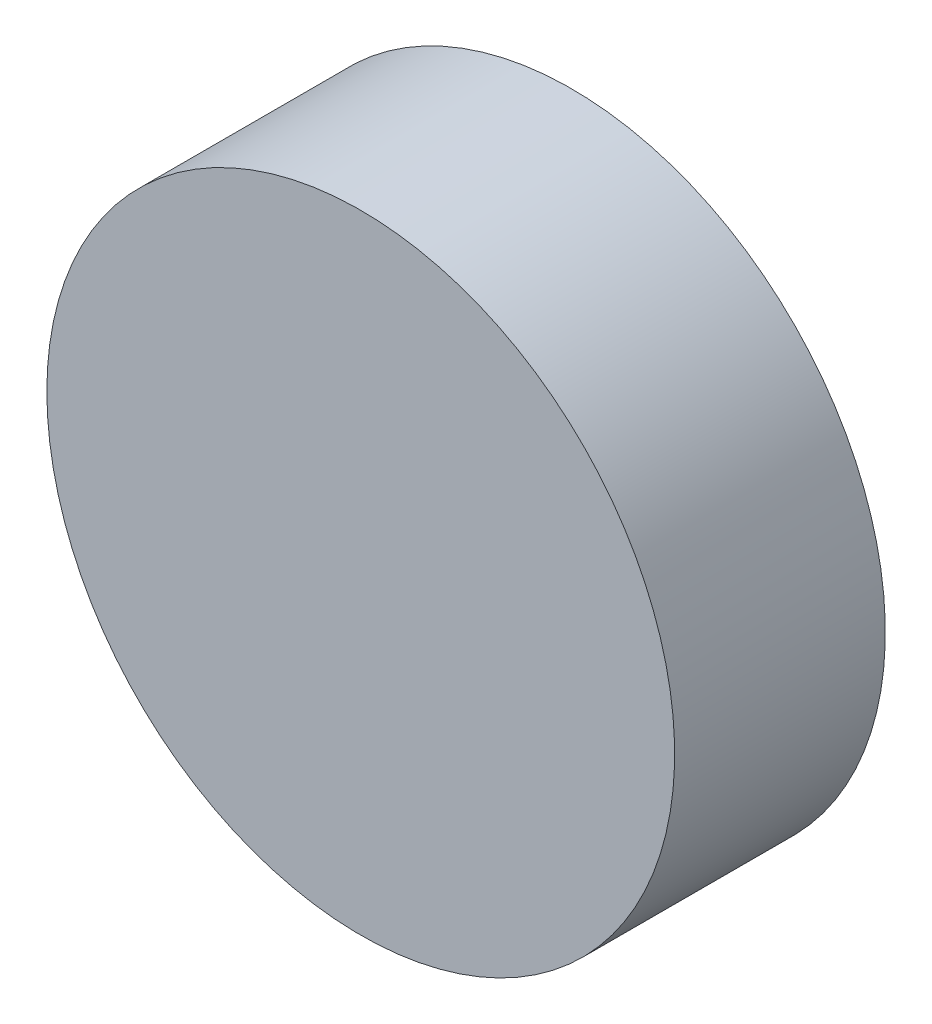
ISO-10303-21;
HEADER;
FILE_DESCRIPTION(('STEP AP214'),'2;1');
FILE_NAME('part.step','',(''),(''),'','','');
FILE_SCHEMA(('AUTOMOTIVE_DESIGN { 1 0 10303 214 1 1 1 1 }'));
ENDSEC;
DATA;
#1=APPLICATION_CONTEXT('core data for automotive mechanical design processes');
#2=APPLICATION_PROTOCOL_DEFINITION('international standard','automotive_design',2000,#1);
#3=PRODUCT_CONTEXT('',#1,'mechanical');
#4=PRODUCT('Part','Part','',(#3));
#5=PRODUCT_RELATED_PRODUCT_CATEGORY('part','',(#4));
#6=PRODUCT_DEFINITION_FORMATION('','',#4);
#7=PRODUCT_DEFINITION_CONTEXT('part definition',#1,'design');
#8=PRODUCT_DEFINITION('design','',#6,#7);
#9=PRODUCT_DEFINITION_SHAPE('','',#8);
#10=(LENGTH_UNIT() NAMED_UNIT(*) SI_UNIT(.MILLI.,.METRE.));
#11=(NAMED_UNIT(*) PLANE_ANGLE_UNIT() SI_UNIT($,.RADIAN.));
#12=(NAMED_UNIT(*) SI_UNIT($,.STERADIAN.) SOLID_ANGLE_UNIT());
#13=UNCERTAINTY_MEASURE_WITH_UNIT(LENGTH_MEASURE(1.E-05),#10,'distance_accuracy_value','');
#14=(GEOMETRIC_REPRESENTATION_CONTEXT(3) GLOBAL_UNCERTAINTY_ASSIGNED_CONTEXT((#13)) GLOBAL_UNIT_ASSIGNED_CONTEXT((#10,
#11,#12)) REPRESENTATION_CONTEXT('',''));
#15=CARTESIAN_POINT('',(0.,0.,0.));
#16=DIRECTION('',(0.,0.,1.));
#17=DIRECTION('',(1.,0.,0.));
#18=AXIS2_PLACEMENT_3D('',#15,#16,#17);
#19=CARTESIAN_POINT('',(0.,0.,19.177));
#20=DIRECTION('',(0.,0.,-1.));
#21=DIRECTION('',(-1.,0.,0.));
#22=AXIS2_PLACEMENT_3D('',#19,#20,#21);
#23=CYLINDRICAL_SURFACE('',#22,28.575);
#24=CARTESIAN_POINT('',(0.,0.,19.177));
#25=DIRECTION('',(0.,0.,1.));
#26=DIRECTION('',(1.,0.,0.));
#27=AXIS2_PLACEMENT_3D('',#24,#25,#26);
#28=CIRCLE('',#27,28.575);
#29=CARTESIAN_POINT('',(-28.575,0.,19.177));
#30=VERTEX_POINT('',#29);
#31=EDGE_CURVE('E10',#30,#30,#28,.T.);
#32=CARTESIAN_POINT('',(0.,0.,0.));
#33=DIRECTION('',(0.,0.,1.));
#34=DIRECTION('',(1.,0.,0.));
#35=AXIS2_PLACEMENT_3D('',#32,#33,#34);
#36=CIRCLE('',#35,28.575);
#37=CARTESIAN_POINT('',(-28.575,0.,0.));
#38=VERTEX_POINT('',#37);
#39=EDGE_CURVE('E37',#38,#38,#36,.T.);
#40=CARTESIAN_POINT('',(-28.575,0.,19.177));
#41=CARTESIAN_POINT('',(-28.575,0.,18.9772395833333));
#42=CARTESIAN_POINT('',(-28.575,0.,18.7774791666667));
#43=CARTESIAN_POINT('',(-28.575,0.,18.3779583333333));
#44=CARTESIAN_POINT('',(-28.575,0.,18.1781979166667));
#45=CARTESIAN_POINT('',(-28.575,0.,17.7786770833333));
#46=CARTESIAN_POINT('',(-28.575,0.,17.5789166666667));
#47=CARTESIAN_POINT('',(-28.575,0.,17.1793958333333));
#48=CARTESIAN_POINT('',(-28.575,0.,16.9796354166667));
#49=CARTESIAN_POINT('',(-28.575,0.,16.5801145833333));
#50=CARTESIAN_POINT('',(-28.575,0.,16.3803541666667));
#51=CARTESIAN_POINT('',(-28.575,0.,15.9808333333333));
#52=CARTESIAN_POINT('',(-28.575,0.,15.7810729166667));
#53=CARTESIAN_POINT('',(-28.575,0.,15.3815520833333));
#54=CARTESIAN_POINT('',(-28.575,0.,15.1817916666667));
#55=CARTESIAN_POINT('',(-28.575,0.,14.7822708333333));
#56=CARTESIAN_POINT('',(-28.575,0.,14.5825104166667));
#57=CARTESIAN_POINT('',(-28.575,0.,14.1829895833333));
#58=CARTESIAN_POINT('',(-28.575,0.,13.9832291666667));
#59=CARTESIAN_POINT('',(-28.575,0.,13.5837083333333));
#60=CARTESIAN_POINT('',(-28.575,0.,13.3839479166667));
#61=CARTESIAN_POINT('',(-28.575,0.,12.9844270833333));
#62=CARTESIAN_POINT('',(-28.575,0.,12.7846666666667));
#63=CARTESIAN_POINT('',(-28.575,0.,12.3851458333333));
#64=CARTESIAN_POINT('',(-28.575,0.,12.1853854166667));
#65=CARTESIAN_POINT('',(-28.575,0.,11.7858645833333));
#66=CARTESIAN_POINT('',(-28.575,0.,11.5861041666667));
#67=CARTESIAN_POINT('',(-28.575,0.,11.1865833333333));
#68=CARTESIAN_POINT('',(-28.575,0.,10.9868229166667));
#69=CARTESIAN_POINT('',(-28.575,0.,10.5873020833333));
#70=CARTESIAN_POINT('',(-28.575,0.,10.3875416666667));
#71=CARTESIAN_POINT('',(-28.575,0.,9.98802083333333));
#72=CARTESIAN_POINT('',(-28.575,0.,9.78826041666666));
#73=CARTESIAN_POINT('',(-28.575,0.,9.38873958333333));
#74=CARTESIAN_POINT('',(-28.575,0.,9.18897916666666));
#75=CARTESIAN_POINT('',(-28.575,0.,8.78945833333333));
#76=CARTESIAN_POINT('',(-28.575,0.,8.58969791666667));
#77=CARTESIAN_POINT('',(-28.575,0.,8.19017708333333));
#78=CARTESIAN_POINT('',(-28.575,0.,7.99041666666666));
#79=CARTESIAN_POINT('',(-28.575,0.,7.59089583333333));
#80=CARTESIAN_POINT('',(-28.575,0.,7.39113541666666));
#81=CARTESIAN_POINT('',(-28.575,0.,6.99161458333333));
#82=CARTESIAN_POINT('',(-28.575,0.,6.79185416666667));
#83=CARTESIAN_POINT('',(-28.575,0.,6.39233333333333));
#84=CARTESIAN_POINT('',(-28.575,0.,6.19257291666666));
#85=CARTESIAN_POINT('',(-28.575,0.,5.79305208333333));
#86=CARTESIAN_POINT('',(-28.575,0.,5.59329166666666));
#87=CARTESIAN_POINT('',(-28.575,0.,5.19377083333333));
#88=CARTESIAN_POINT('',(-28.575,0.,4.99401041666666));
#89=CARTESIAN_POINT('',(-28.575,0.,4.59448958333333));
#90=CARTESIAN_POINT('',(-28.575,0.,4.39472916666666));
#91=CARTESIAN_POINT('',(-28.575,0.,3.99520833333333));
#92=CARTESIAN_POINT('',(-28.575,0.,3.79544791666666));
#93=CARTESIAN_POINT('',(-28.575,0.,3.39592708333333));
#94=CARTESIAN_POINT('',(-28.575,0.,3.19616666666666));
#95=CARTESIAN_POINT('',(-28.575,0.,2.79664583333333));
#96=CARTESIAN_POINT('',(-28.575,0.,2.59688541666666));
#97=CARTESIAN_POINT('',(-28.575,0.,2.19736458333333));
#98=CARTESIAN_POINT('',(-28.575,0.,1.99760416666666));
#99=CARTESIAN_POINT('',(-28.575,0.,1.59808333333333));
#100=CARTESIAN_POINT('',(-28.575,0.,1.39832291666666));
#101=CARTESIAN_POINT('',(-28.575,0.,0.99880208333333));
#102=CARTESIAN_POINT('',(-28.575,0.,0.799041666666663));
#103=CARTESIAN_POINT('',(-28.575,0.,0.39952083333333));
#104=CARTESIAN_POINT('',(-28.575,0.,0.199760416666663));
#105=CARTESIAN_POINT('',(-28.575,0.,0.));
#106=B_SPLINE_CURVE_WITH_KNOTS('',3,(#40,#41,#42,#43,#44,#45,#46,#47,#48,#49,#50,#51,#52,#53,
#54,#55,#56,#57,#58,#59,#60,#61,#62,#63,#64,#65,#66,#67,#68,#69,#70,#71,#72,#73,#74,#75,#76,#77,
#78,#79,#80,#81,#82,#83,#84,#85,#86,#87,#88,#89,#90,#91,#92,#93,#94,#95,#96,#97,#98,#99,#100,
#101,#102,#103,#104,#105),.UNSPECIFIED.,.F.,.F.,(4,2,2,2,2,2,2,2,2,2,2,2,2,2,2,2,2,2,2,2,2,2,2,
2,2,2,2,2,2,2,2,2,4),(0.,0.599281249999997,1.1985625,1.79784375,2.397125,2.99640625,3.5956875,
4.19496875,4.79425,5.39353125,5.9928125,6.59209375,7.191375,7.79065625,8.3899375,8.98921875,
9.5885,10.18778125,10.7870625,11.38634375,11.985625,12.58490625,13.1841875,13.78346875,14.38275,
14.98203125,15.5813125,16.18059375,16.779875,17.37915625,17.9784375,18.57771875,19.177),.UNSPECIFIED.);
#107=EDGE_CURVE('BSEAM34',#30,#38,#106,.T.);
#108=ORIENTED_EDGE('',*,*,#31,.F.);
#109=ORIENTED_EDGE('',*,*,#39,.T.);
#110=ORIENTED_EDGE('',*,*,#107,.T.);
#111=ORIENTED_EDGE('',*,*,#107,.F.);
#112=EDGE_LOOP('',(#108,#110,#109,#111));
#113=FACE_BOUND('',#112,.T.);
#114=ADVANCED_FACE('F34',(#113),#23,.T.);
#115=CARTESIAN_POINT('',(0.,0.,19.177));
#116=DIRECTION('',(0.,0.,1.));
#117=DIRECTION('',(1.,0.,0.));
#118=AXIS2_PLACEMENT_3D('',#115,#116,#117);
#119=PLANE('',#118);
#120=ORIENTED_EDGE('',*,*,#31,.T.);
#121=EDGE_LOOP('',(#120));
#122=FACE_BOUND('',#121,.T.);
#123=ADVANCED_FACE('F49',(#122),#119,.T.);
#124=CARTESIAN_POINT('',(0.,0.,0.));
#125=DIRECTION('',(0.,0.,1.));
#126=DIRECTION('',(1.,0.,0.));
#127=AXIS2_PLACEMENT_3D('',#124,#125,#126);
#128=PLANE('',#127);
#129=ORIENTED_EDGE('',*,*,#39,.F.);
#130=EDGE_LOOP('',(#129));
#131=FACE_BOUND('',#130,.T.);
#132=ADVANCED_FACE('F47',(#131),#128,.F.);
#133=CLOSED_SHELL('',(#114,#123,#132));
#134=MANIFOLD_SOLID_BREP('B2',#133);
#135=ADVANCED_BREP_SHAPE_REPRESENTATION('',(#18,#134),#14);
#136=SHAPE_DEFINITION_REPRESENTATION(#9,#135);
ENDSEC;
END-ISO-10303-21;
